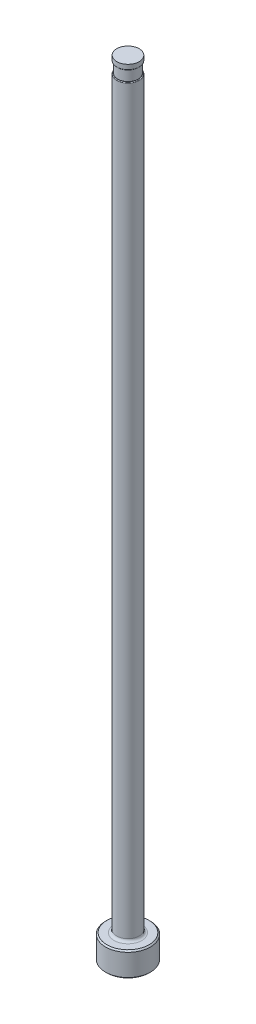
from build123d import *

# Parameters (mm, degrees)
CHAMFER1_SIZE     = 0.254
FILLET1_R         = 0.508
SKETCH2_W         = 0.2032
SKETCH2_H         = 2.032
D_SLOT_DEPTH      = 153.524461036
D_SLOT_DEPTH_BACK = 153.524461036
SKETCH5_W         = 0.00508
SKETCH5_H         = 1.016
FILLET2_R         = 0.127


with BuildPart() as part:
    # Sketch1 → Revolve1 (revolve)
    with BuildSketch(Plane.XY, mode=Mode.PRIVATE) as revolve1_sk:
        Polygon((0, 0), (-4.3561, 0), (-4.3561, 4.7498), (-2.18186, 4.7498), (-2.18186, 152.4), (0, 152.4), align=None)
    revolve(revolve1_sk.sketch.rotate(Axis((0, 259.958771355, 0), (0, -1, 0)), 270), axis=Axis((0, 259.958771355, 0), (0, -1, 0)))

    # Chamfer1
    chamfer1_edges = [part.edges().sort_by_distance(p)[0] for p in [
        (0, 4.7498, -4.3561),
        (0, 0, -4.3561),
    ]]
    chamfer(chamfer1_edges, length=CHAMFER1_SIZE)

    # Fillet1
    fillet1_edges = [part.edges().sort_by_distance(p)[0] for p in [
        (0, 4.7498, -2.18186),
    ]]
    fillet(fillet1_edges, radius=FILLET1_R)

    # Sketch2 → Vent Relief (revolve, cut)
    with BuildSketch(Plane.XY, mode=Mode.PRIVATE) as vent_relief_sk:
        with Locations((-2.08026, 150.368)):
            Rectangle(SKETCH2_W, SKETCH2_H)
    revolve(vent_relief_sk.sketch.rotate(Axis((0, 153.448281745, 0), (0, -1, 0)), 270), axis=Axis((0, 153.448281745, 0), (0, -1, 0)), mode=Mode.SUBTRACT)

    # Sketch3 → D-Slot (cut, two sides: drawn at the far end of the back side and taken through both)
    with BuildSketch(Plane.XY.offset(-D_SLOT_DEPTH_BACK)):
        with BuildLine():
            Line((-1.97866, 150.368), (-1.97866, 86.868))
            ThreePointArc((-1.97866, 86.868), (-2.029873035, 86.300038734), (-2.18186, 85.7504))
            Line((-2.18186, 85.7504), (-2.18186, 150.368))
            Line((-2.18186, 150.368), (-1.97866, 150.368))
        make_face()
    extrude(amount=D_SLOT_DEPTH + D_SLOT_DEPTH_BACK, mode=Mode.SUBTRACT)

    # Sketch5 → Vent Diameter (revolve, cut)
    with BuildSketch(Plane.XY, mode=Mode.PRIVATE) as vent_diameter_sk:
        with Locations((-2.17932, 151.892)):
            Rectangle(SKETCH5_W, SKETCH5_H)
    revolve(vent_diameter_sk.sketch.rotate(Axis((0, 152.687735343, 0), (0, -1, 0)), 90), axis=Axis((0, 152.687735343, 0), (0, -1, 0)), mode=Mode.SUBTRACT)

    # Fillet2
    fillet2_edges = [part.edges().sort_by_distance(p)[0] for p in [
        (1.839382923, 149.352, -1.173534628),
        (0, 151.384, 2.17678),
    ]]
    fillet(fillet2_edges, radius=FILLET2_R)


solid = part.part
